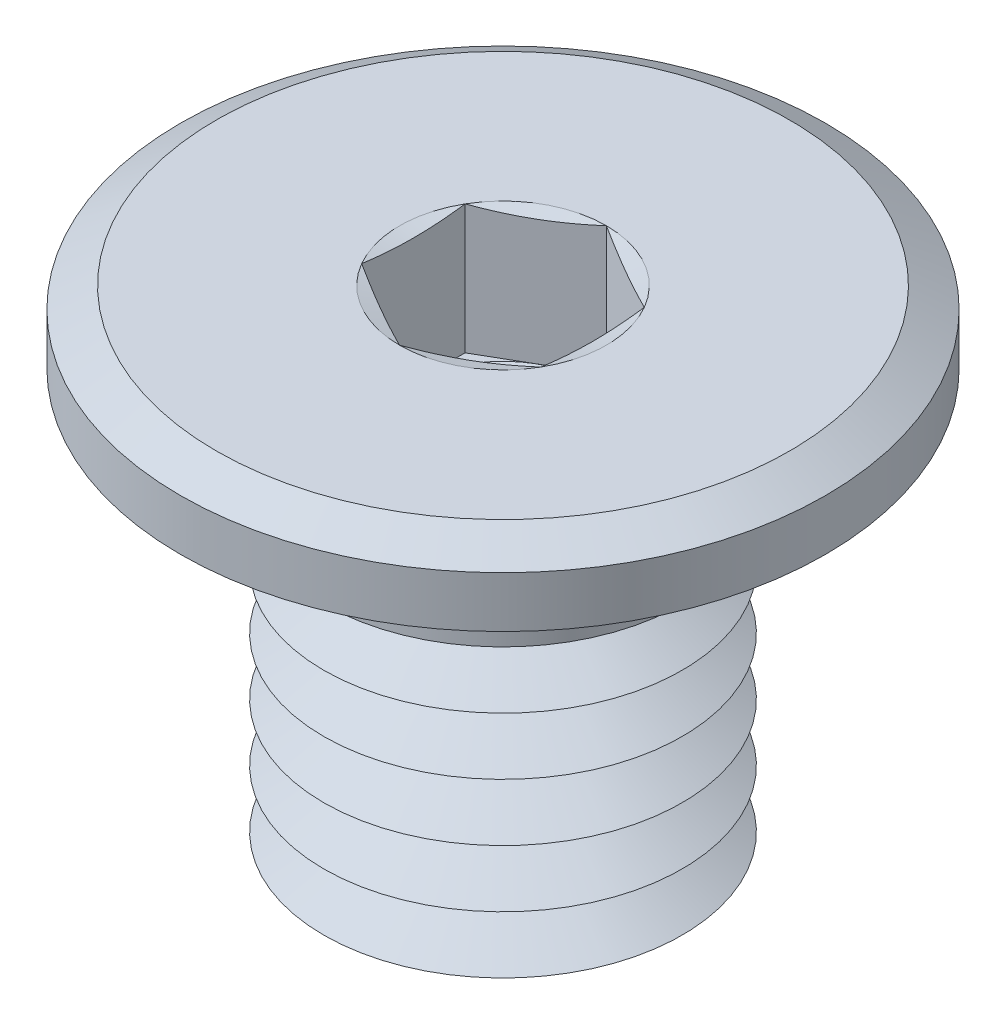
from build123d import *

# Parameters (mm, degrees)
SKETCH1_R           = 4.5
BOSS_EXTRUDE1_DEPTH = 1
SKETCH2_R           = 2.5
BOSS_EXTRUDE2_DEPTH = 6
LPATTERN1_COUNT     = 6
LPATTERN1_PITCH     = 0.8
FILLET1_R           = 0.2
CHAMFER2_SIZE       = 0.5
CHAMFER2_SIZE2      = 0.288675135
CUT_EXTRUDE1_DEPTH  = 1.8


with BuildPart() as part:
    # Sketch1 → Boss-Extrude1 (new body)
    with BuildSketch(Plane(origin=(0, 0, 0), x_dir=(1, 0, 0), z_dir=(0, 1, 0))):
        with Locations(Location((0, 0, 0), (0, 0, 270))):
            Circle(SKETCH1_R)
    extrude(amount=-BOSS_EXTRUDE1_DEPTH)

    # Sketch2 → Boss-Extrude2 (add)
    with BuildSketch(Plane.XZ.offset(1)):
        with Locations(Location((0, 0, 0), (0, 0, 270))):
            Circle(SKETCH2_R)
    extrude(amount=BOSS_EXTRUDE2_DEPTH)

    # Sketch5 → Cut-Revolve1 (revolve, cut)
    with BuildSketch(Plane(origin=(0, 0, 0), x_dir=(0, 0, -1), z_dir=(1, 0, 0))):
        Polygon((-2.5, -7.4), (-1.807179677, -7), (-2.5, -6.6), align=None)
    cut_revolve1 = revolve(axis=Axis((0, 0.990593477, 0), (0, -1, 0)), mode=Mode.SUBTRACT)

    # LPattern1: Cut-Revolve1 ×6
    with Locations(*[(0, i * LPATTERN1_PITCH, 0) for i in range(1, LPATTERN1_COUNT)]):
        add(cut_revolve1, mode=Mode.SUBTRACT)

    # Fillet1
    fillet1_edges = [part.edges().sort_by_distance(p)[0] for p in [
        (0, -1, 2.5),
    ]]
    fillet(fillet1_edges, radius=FILLET1_R)

    # Chamfer2
    chamfer2_edges = [part.edges().sort_by_distance(p)[0] for p in [
        (0, 0, -4.5),
    ]]
    chamfer2_side = [part.faces().sort_by_distance(p)[0] for p in [
        (0, 0, 0),
    ]]
    chamfer(chamfer2_edges, length=CHAMFER2_SIZE, length2=CHAMFER2_SIZE2, reference=chamfer2_side[0])

    # Sketch6 → Cut-Extrude1 (cut)
    with BuildSketch(Plane(origin=(0, 0, 0), x_dir=(1, 0, 0), z_dir=(0, 1, 0))):
        Polygon((0, 1.443375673), (-1.25, 0.721687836), (-1.25, -0.721687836), (0, -1.443375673), (1.25, -0.721687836), (1.25, 0.721687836), align=None)
    extrude(amount=-CUT_EXTRUDE1_DEPTH, mode=Mode.SUBTRACT)

    # Cut-Extrude2 cone 1 section (on through the dimple's axis) → Cut-Extrude2 (revolve, cut)
    with BuildSketch(Plane(origin=(0, -1.8, 0), x_dir=(0, 0, 1), z_dir=(1, 0, 0))):
        Polygon((0, 0), (1.25, 0), (0, 0.721687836), align=None)
    revolve(axis=Axis((0, -1.8, 0), (0, -1, 0)), mode=Mode.SUBTRACT)

    # Cut-Extrude3 cone 1 section (on through the dimple's axis) → Cut-Extrude3 (revolve, cut)
    with BuildSketch(Plane(origin=(0, 0, 0), x_dir=(0, 0, 1), z_dir=(1, 0, 0))):
        Polygon((0, 0), (1.443375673, 0), (0, 0.386751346), align=None)
    revolve(axis=Axis((0, 0, 0), (0, -1, 0)), mode=Mode.SUBTRACT)


solid = part.part
